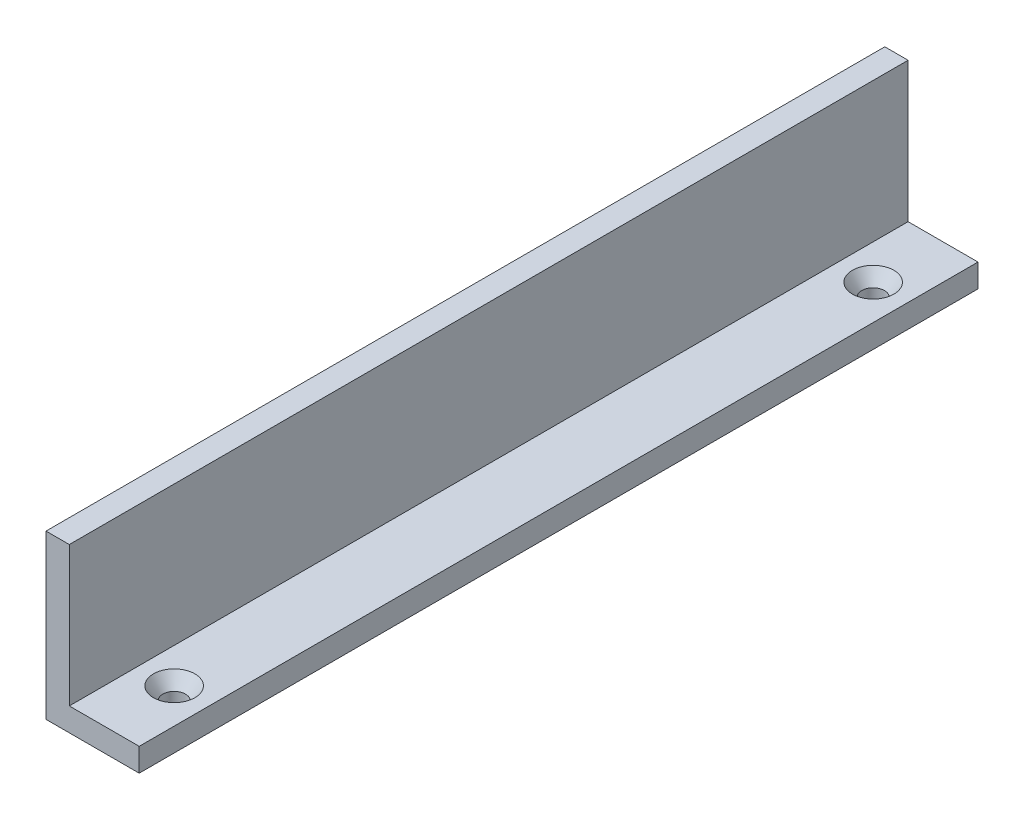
ISO-10303-21;
HEADER;
FILE_DESCRIPTION(('STEP AP214'),'2;1');
FILE_NAME('part.step','',(''),(''),'','','');
FILE_SCHEMA(('AUTOMOTIVE_DESIGN { 1 0 10303 214 1 1 1 1 }'));
ENDSEC;
DATA;
#1=APPLICATION_CONTEXT('core data for automotive mechanical design processes');
#2=APPLICATION_PROTOCOL_DEFINITION('international standard','automotive_design',2000,#1);
#3=PRODUCT_CONTEXT('',#1,'mechanical');
#4=PRODUCT('Part','Part','',(#3));
#5=PRODUCT_RELATED_PRODUCT_CATEGORY('part','',(#4));
#6=PRODUCT_DEFINITION_FORMATION('','',#4);
#7=PRODUCT_DEFINITION_CONTEXT('part definition',#1,'design');
#8=PRODUCT_DEFINITION('design','',#6,#7);
#9=PRODUCT_DEFINITION_SHAPE('','',#8);
#10=(LENGTH_UNIT() NAMED_UNIT(*) SI_UNIT(.MILLI.,.METRE.));
#11=(NAMED_UNIT(*) PLANE_ANGLE_UNIT() SI_UNIT($,.RADIAN.));
#12=(NAMED_UNIT(*) SI_UNIT($,.STERADIAN.) SOLID_ANGLE_UNIT());
#13=UNCERTAINTY_MEASURE_WITH_UNIT(LENGTH_MEASURE(1.E-05),#10,'distance_accuracy_value','');
#14=(GEOMETRIC_REPRESENTATION_CONTEXT(3) GLOBAL_UNCERTAINTY_ASSIGNED_CONTEXT((#13)) GLOBAL_UNIT_ASSIGNED_CONTEXT((#10,
#11,#12)) REPRESENTATION_CONTEXT('',''));
#15=CARTESIAN_POINT('',(0.,0.,0.));
#16=DIRECTION('',(0.,0.,1.));
#17=DIRECTION('',(1.,0.,0.));
#18=AXIS2_PLACEMENT_3D('',#15,#16,#17);
#19=CARTESIAN_POINT('',(3.175,0.,114.3));
#20=DIRECTION('',(0.,-1.,0.));
#21=DIRECTION('',(1.,0.,0.));
#22=AXIS2_PLACEMENT_3D('',#19,#20,#21);
#23=PLANE('',#22);
#24=DIRECTION('',(-1.,0.,0.));
#25=VECTOR('',#24,1.);
#26=CARTESIAN_POINT('',(3.175,0.,0.));
#27=LINE('',#26,#25);
#28=CARTESIAN_POINT('',(3.175,0.,0.));
#29=VERTEX_POINT('',#28);
#30=CARTESIAN_POINT('',(0.,0.,0.));
#31=VERTEX_POINT('',#30);
#32=EDGE_CURVE('E119',#29,#31,#27,.T.);
#33=ORIENTED_EDGE('',*,*,#32,.T.);
#34=DIRECTION('',(0.,0.,-1.));
#35=VECTOR('',#34,1.);
#36=CARTESIAN_POINT('',(0.,0.,114.3));
#37=LINE('',#36,#35);
#38=CARTESIAN_POINT('',(0.,0.,114.3));
#39=VERTEX_POINT('',#38);
#40=EDGE_CURVE('E11',#39,#31,#37,.T.);
#41=ORIENTED_EDGE('',*,*,#40,.F.);
#42=DIRECTION('',(-1.,0.,0.));
#43=VECTOR('',#42,1.);
#44=CARTESIAN_POINT('',(3.175,0.,114.3));
#45=LINE('',#44,#43);
#46=CARTESIAN_POINT('',(3.175,0.,114.3));
#47=VERTEX_POINT('',#46);
#48=EDGE_CURVE('E130',#47,#39,#45,.T.);
#49=ORIENTED_EDGE('',*,*,#48,.F.);
#50=DIRECTION('',(0.,0.,-1.));
#51=VECTOR('',#50,1.);
#52=CARTESIAN_POINT('',(3.175,0.,114.3));
#53=LINE('',#52,#51);
#54=EDGE_CURVE('E115',#47,#29,#53,.T.);
#55=ORIENTED_EDGE('',*,*,#54,.T.);
#56=EDGE_LOOP('',(#33,#41,#49,#55));
#57=FACE_BOUND('',#56,.T.);
#58=ADVANCED_FACE('F33',(#57),#23,.F.);
#59=CARTESIAN_POINT('',(0.,0.,114.3));
#60=DIRECTION('',(1.,0.,0.));
#61=DIRECTION('',(0.,1.,0.));
#62=AXIS2_PLACEMENT_3D('',#59,#60,#61);
#63=PLANE('',#62);
#64=DIRECTION('',(0.,-1.,0.));
#65=VECTOR('',#64,1.);
#66=CARTESIAN_POINT('',(0.,0.,0.));
#67=LINE('',#66,#65);
#68=CARTESIAN_POINT('',(0.,-22.225,0.));
#69=VERTEX_POINT('',#68);
#70=EDGE_CURVE('E122',#31,#69,#67,.T.);
#71=ORIENTED_EDGE('',*,*,#70,.T.);
#72=DIRECTION('',(0.,0.,-1.));
#73=VECTOR('',#72,1.);
#74=CARTESIAN_POINT('',(0.,-22.225,114.3));
#75=LINE('',#74,#73);
#76=CARTESIAN_POINT('',(0.,-22.225,114.3));
#77=VERTEX_POINT('',#76);
#78=EDGE_CURVE('E42',#77,#69,#75,.T.);
#79=ORIENTED_EDGE('',*,*,#78,.F.);
#80=DIRECTION('',(0.,-1.,0.));
#81=VECTOR('',#80,1.);
#82=CARTESIAN_POINT('',(0.,0.,114.3));
#83=LINE('',#82,#81);
#84=EDGE_CURVE('E88',#39,#77,#83,.T.);
#85=ORIENTED_EDGE('',*,*,#84,.F.);
#86=ORIENTED_EDGE('',*,*,#40,.T.);
#87=EDGE_LOOP('',(#71,#79,#85,#86));
#88=FACE_BOUND('',#87,.T.);
#89=ADVANCED_FACE('F151',(#88),#63,.F.);
#90=CARTESIAN_POINT('',(0.,-22.225,114.3));
#91=DIRECTION('',(0.,1.,0.));
#92=DIRECTION('',(0.,0.,1.));
#93=AXIS2_PLACEMENT_3D('',#90,#91,#92);
#94=PLANE('',#93);
#95=CARTESIAN_POINT('',(7.93750000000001,-22.225,9.52500000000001));
#96=DIRECTION('',(0.,1.,0.));
#97=DIRECTION('',(0.,0.,1.));
#98=AXIS2_PLACEMENT_3D('',#95,#96,#97);
#99=CIRCLE('',#98,1.54304418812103);
#100=CARTESIAN_POINT('',(7.93750000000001,-22.225,11.068044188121));
#101=VERTEX_POINT('',#100);
#102=EDGE_CURVE('E36',#101,#101,#99,.T.);
#103=ORIENTED_EDGE('',*,*,#102,.T.);
#104=EDGE_LOOP('',(#103));
#105=FACE_BOUND('',#104,.T.);
#106=CARTESIAN_POINT('',(7.93750000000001,-22.225,104.775));
#107=DIRECTION('',(0.,1.,0.));
#108=DIRECTION('',(0.,0.,1.));
#109=AXIS2_PLACEMENT_3D('',#106,#107,#108);
#110=CIRCLE('',#109,1.54304418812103);
#111=CARTESIAN_POINT('',(7.93750000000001,-22.225,106.318044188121));
#112=VERTEX_POINT('',#111);
#113=EDGE_CURVE('E123',#112,#112,#110,.T.);
#114=ORIENTED_EDGE('',*,*,#113,.T.);
#115=EDGE_LOOP('',(#114));
#116=FACE_BOUND('',#115,.T.);
#117=DIRECTION('',(1.,0.,0.));
#118=VECTOR('',#117,1.);
#119=CARTESIAN_POINT('',(0.,-22.225,0.));
#120=LINE('',#119,#118);
#121=CARTESIAN_POINT('',(12.7,-22.225,0.));
#122=VERTEX_POINT('',#121);
#123=EDGE_CURVE('E125',#69,#122,#120,.T.);
#124=ORIENTED_EDGE('',*,*,#123,.T.);
#125=DIRECTION('',(0.,0.,-1.));
#126=VECTOR('',#125,1.);
#127=CARTESIAN_POINT('',(12.7,-22.225,114.3));
#128=LINE('',#127,#126);
#129=CARTESIAN_POINT('',(12.7,-22.225,114.3));
#130=VERTEX_POINT('',#129);
#131=EDGE_CURVE('E110',#130,#122,#128,.T.);
#132=ORIENTED_EDGE('',*,*,#131,.F.);
#133=DIRECTION('',(1.,0.,0.));
#134=VECTOR('',#133,1.);
#135=CARTESIAN_POINT('',(0.,-22.225,114.3));
#136=LINE('',#135,#134);
#137=EDGE_CURVE('E101',#77,#130,#136,.T.);
#138=ORIENTED_EDGE('',*,*,#137,.F.);
#139=ORIENTED_EDGE('',*,*,#78,.T.);
#140=EDGE_LOOP('',(#124,#132,#138,#139));
#141=FACE_BOUND('',#140,.T.);
#142=ADVANCED_FACE('F154',(#105,#116,#141),#94,.F.);
#143=CARTESIAN_POINT('',(12.7,-22.225,114.3));
#144=DIRECTION('',(-1.,0.,0.));
#145=DIRECTION('',(0.,0.,1.));
#146=AXIS2_PLACEMENT_3D('',#143,#144,#145);
#147=PLANE('',#146);
#148=DIRECTION('',(0.,1.,0.));
#149=VECTOR('',#148,1.);
#150=CARTESIAN_POINT('',(12.7,-22.225,0.));
#151=LINE('',#150,#149);
#152=CARTESIAN_POINT('',(12.7,-19.05,0.));
#153=VERTEX_POINT('',#152);
#154=EDGE_CURVE('E109',#122,#153,#151,.T.);
#155=ORIENTED_EDGE('',*,*,#154,.T.);
#156=DIRECTION('',(0.,0.,-1.));
#157=VECTOR('',#156,1.);
#158=CARTESIAN_POINT('',(12.7,-19.05,114.3));
#159=LINE('',#158,#157);
#160=CARTESIAN_POINT('',(12.7,-19.05,114.3));
#161=VERTEX_POINT('',#160);
#162=EDGE_CURVE('E106',#161,#153,#159,.T.);
#163=ORIENTED_EDGE('',*,*,#162,.F.);
#164=DIRECTION('',(0.,1.,0.));
#165=VECTOR('',#164,1.);
#166=CARTESIAN_POINT('',(12.7,-22.225,114.3));
#167=LINE('',#166,#165);
#168=EDGE_CURVE('E95',#130,#161,#167,.T.);
#169=ORIENTED_EDGE('',*,*,#168,.F.);
#170=ORIENTED_EDGE('',*,*,#131,.T.);
#171=EDGE_LOOP('',(#155,#163,#169,#170));
#172=FACE_BOUND('',#171,.T.);
#173=ADVANCED_FACE('F107',(#172),#147,.F.);
#174=CARTESIAN_POINT('',(12.7,-19.05,114.3));
#175=DIRECTION('',(0.,-1.,0.));
#176=DIRECTION('',(0.,0.,-1.));
#177=AXIS2_PLACEMENT_3D('',#174,#175,#176);
#178=PLANE('',#177);
#179=CARTESIAN_POINT('',(7.93750000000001,-19.05,9.52500000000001));
#180=DIRECTION('',(0.,-1.,0.));
#181=DIRECTION('',(0.,0.,-1.));
#182=AXIS2_PLACEMENT_3D('',#179,#180,#181);
#183=CIRCLE('',#182,2.82171279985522);
#184=CARTESIAN_POINT('',(7.93750000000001,-19.05,6.70328720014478));
#185=VERTEX_POINT('',#184);
#186=EDGE_CURVE('E260',#185,#185,#183,.T.);
#187=ORIENTED_EDGE('',*,*,#186,.T.);
#188=EDGE_LOOP('',(#187));
#189=FACE_BOUND('',#188,.T.);
#190=CARTESIAN_POINT('',(7.93750000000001,-19.05,104.775));
#191=DIRECTION('',(0.,1.,0.));
#192=DIRECTION('',(0.,0.,1.));
#193=AXIS2_PLACEMENT_3D('',#190,#191,#192);
#194=CIRCLE('',#193,2.82171279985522);
#195=CARTESIAN_POINT('',(7.93750000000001,-19.05,107.596712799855));
#196=VERTEX_POINT('',#195);
#197=EDGE_CURVE('E136',#196,#196,#194,.T.);
#198=ORIENTED_EDGE('',*,*,#197,.F.);
#199=EDGE_LOOP('',(#198));
#200=FACE_BOUND('',#199,.T.);
#201=DIRECTION('',(-1.,0.,0.));
#202=VECTOR('',#201,1.);
#203=CARTESIAN_POINT('',(12.7,-19.05,0.));
#204=LINE('',#203,#202);
#205=CARTESIAN_POINT('',(3.175,-19.05,0.));
#206=VERTEX_POINT('',#205);
#207=EDGE_CURVE('E74',#153,#206,#204,.T.);
#208=ORIENTED_EDGE('',*,*,#207,.T.);
#209=DIRECTION('',(0.,0.,-1.));
#210=VECTOR('',#209,1.);
#211=CARTESIAN_POINT('',(3.175,-19.05,114.3));
#212=LINE('',#211,#210);
#213=CARTESIAN_POINT('',(3.175,-19.05,114.3));
#214=VERTEX_POINT('',#213);
#215=EDGE_CURVE('E111',#214,#206,#212,.T.);
#216=ORIENTED_EDGE('',*,*,#215,.F.);
#217=DIRECTION('',(-1.,0.,0.));
#218=VECTOR('',#217,1.);
#219=CARTESIAN_POINT('',(12.7,-19.05,114.3));
#220=LINE('',#219,#218);
#221=EDGE_CURVE('E99',#161,#214,#220,.T.);
#222=ORIENTED_EDGE('',*,*,#221,.F.);
#223=ORIENTED_EDGE('',*,*,#162,.T.);
#224=EDGE_LOOP('',(#208,#216,#222,#223));
#225=FACE_BOUND('',#224,.T.);
#226=ADVANCED_FACE('F113',(#189,#200,#225),#178,.F.);
#227=CARTESIAN_POINT('',(3.175,-19.05,114.3));
#228=DIRECTION('',(-1.,0.,0.));
#229=DIRECTION('',(0.,-1.,0.));
#230=AXIS2_PLACEMENT_3D('',#227,#228,#229);
#231=PLANE('',#230);
#232=DIRECTION('',(0.,1.,0.));
#233=VECTOR('',#232,1.);
#234=CARTESIAN_POINT('',(3.175,-19.05,0.));
#235=LINE('',#234,#233);
#236=EDGE_CURVE('E80',#206,#29,#235,.T.);
#237=ORIENTED_EDGE('',*,*,#236,.T.);
#238=ORIENTED_EDGE('',*,*,#54,.F.);
#239=DIRECTION('',(0.,1.,0.));
#240=VECTOR('',#239,1.);
#241=CARTESIAN_POINT('',(3.175,-19.05,114.3));
#242=LINE('',#241,#240);
#243=EDGE_CURVE('E51',#214,#47,#242,.T.);
#244=ORIENTED_EDGE('',*,*,#243,.F.);
#245=ORIENTED_EDGE('',*,*,#215,.T.);
#246=EDGE_LOOP('',(#237,#238,#244,#245));
#247=FACE_BOUND('',#246,.T.);
#248=ADVANCED_FACE('F159',(#247),#231,.F.);
#249=CARTESIAN_POINT('',(0.,0.,114.3));
#250=DIRECTION('',(0.,0.,1.));
#251=DIRECTION('',(1.,0.,0.));
#252=AXIS2_PLACEMENT_3D('',#249,#250,#251);
#253=PLANE('',#252);
#254=ORIENTED_EDGE('',*,*,#48,.T.);
#255=ORIENTED_EDGE('',*,*,#84,.T.);
#256=ORIENTED_EDGE('',*,*,#137,.T.);
#257=ORIENTED_EDGE('',*,*,#168,.T.);
#258=ORIENTED_EDGE('',*,*,#221,.T.);
#259=ORIENTED_EDGE('',*,*,#243,.T.);
#260=EDGE_LOOP('',(#254,#255,#256,#257,#258,#259));
#261=FACE_BOUND('',#260,.T.);
#262=ADVANCED_FACE('F97',(#261),#253,.T.);
#263=CARTESIAN_POINT('',(0.,0.,0.));
#264=DIRECTION('',(0.,0.,1.));
#265=DIRECTION('',(1.,0.,0.));
#266=AXIS2_PLACEMENT_3D('',#263,#264,#265);
#267=PLANE('',#266);
#268=ORIENTED_EDGE('',*,*,#32,.F.);
#269=ORIENTED_EDGE('',*,*,#236,.F.);
#270=ORIENTED_EDGE('',*,*,#207,.F.);
#271=ORIENTED_EDGE('',*,*,#154,.F.);
#272=ORIENTED_EDGE('',*,*,#123,.F.);
#273=ORIENTED_EDGE('',*,*,#70,.F.);
#274=EDGE_LOOP('',(#268,#269,#270,#271,#272,#273));
#275=FACE_BOUND('',#274,.T.);
#276=ADVANCED_FACE('F157',(#275),#267,.F.);
#277=CARTESIAN_POINT('',(7.93750000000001,-19.9957713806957,104.775));
#278=DIRECTION('',(0.,1.,0.));
#279=DIRECTION('',(0.,0.,1.));
#280=AXIS2_PLACEMENT_3D('',#277,#278,#279);
#281=CYLINDRICAL_SURFACE('',#280,1.54304418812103);
#282=CARTESIAN_POINT('',(7.93750000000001,-20.8014569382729,104.775));
#283=DIRECTION('',(0.,1.,0.));
#284=DIRECTION('',(0.,0.,1.));
#285=AXIS2_PLACEMENT_3D('',#282,#283,#284);
#286=CIRCLE('',#285,1.54304418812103);
#287=CARTESIAN_POINT('',(7.93750000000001,-20.8014569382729,106.318044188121));
#288=VERTEX_POINT('',#287);
#289=EDGE_CURVE('E140',#288,#288,#286,.T.);
#290=ORIENTED_EDGE('',*,*,#289,.T.);
#291=EDGE_LOOP('',(#290));
#292=FACE_BOUND('',#291,.T.);
#293=ORIENTED_EDGE('',*,*,#113,.F.);
#294=EDGE_LOOP('',(#293));
#295=FACE_BOUND('',#294,.T.);
#296=ADVANCED_FACE('F224',(#292,#295),#281,.F.);
#297=CARTESIAN_POINT('',(7.93750000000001,-19.05,104.775));
#298=DIRECTION('',(0.,1.,0.));
#299=DIRECTION('',(0.,0.,1.));
#300=AXIS2_PLACEMENT_3D('',#297,#298,#299);
#301=CONICAL_SURFACE('',#300,2.82171279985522,0.630616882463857);
#302=ORIENTED_EDGE('',*,*,#289,.F.);
#303=EDGE_LOOP('',(#302));
#304=FACE_BOUND('',#303,.T.);
#305=ORIENTED_EDGE('',*,*,#197,.T.);
#306=EDGE_LOOP('',(#305));
#307=FACE_BOUND('',#306,.T.);
#308=ADVANCED_FACE('F204',(#304,#307),#301,.F.);
#309=CARTESIAN_POINT('',(7.93750000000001,-19.9957713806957,9.52500000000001));
#310=DIRECTION('',(0.,1.,0.));
#311=DIRECTION('',(0.,0.,-1.));
#312=AXIS2_PLACEMENT_3D('',#309,#310,#311);
#313=CYLINDRICAL_SURFACE('',#312,1.54304418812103);
#314=CARTESIAN_POINT('',(7.93750000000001,-20.8014569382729,9.52500000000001));
#315=DIRECTION('',(0.,-1.,0.));
#316=DIRECTION('',(0.,0.,-1.));
#317=AXIS2_PLACEMENT_3D('',#314,#315,#316);
#318=CIRCLE('',#317,1.54304418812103);
#319=CARTESIAN_POINT('',(7.93750000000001,-20.8014569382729,7.98195581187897));
#320=VERTEX_POINT('',#319);
#321=EDGE_CURVE('E257',#320,#320,#318,.T.);
#322=ORIENTED_EDGE('',*,*,#321,.F.);
#323=EDGE_LOOP('',(#322));
#324=FACE_BOUND('',#323,.T.);
#325=ORIENTED_EDGE('',*,*,#102,.F.);
#326=EDGE_LOOP('',(#325));
#327=FACE_BOUND('',#326,.T.);
#328=ADVANCED_FACE('F198',(#324,#327),#313,.F.);
#329=CARTESIAN_POINT('',(7.93750000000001,-19.05,9.52500000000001));
#330=DIRECTION('',(0.,1.,0.));
#331=DIRECTION('',(0.,0.,-1.));
#332=AXIS2_PLACEMENT_3D('',#329,#330,#331);
#333=CONICAL_SURFACE('',#332,2.82171279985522,0.630616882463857);
#334=ORIENTED_EDGE('',*,*,#321,.T.);
#335=EDGE_LOOP('',(#334));
#336=FACE_BOUND('',#335,.T.);
#337=ORIENTED_EDGE('',*,*,#186,.F.);
#338=EDGE_LOOP('',(#337));
#339=FACE_BOUND('',#338,.T.);
#340=ADVANCED_FACE('F203',(#336,#339),#333,.F.);
#341=CLOSED_SHELL('',(#58,#89,#142,#173,#226,#248,#262,#276,#296,#308,#328,#340));
#342=MANIFOLD_SOLID_BREP('B2',#341);
#343=ADVANCED_BREP_SHAPE_REPRESENTATION('',(#18,#342),#14);
#344=SHAPE_DEFINITION_REPRESENTATION(#9,#343);
ENDSEC;
END-ISO-10303-21;
